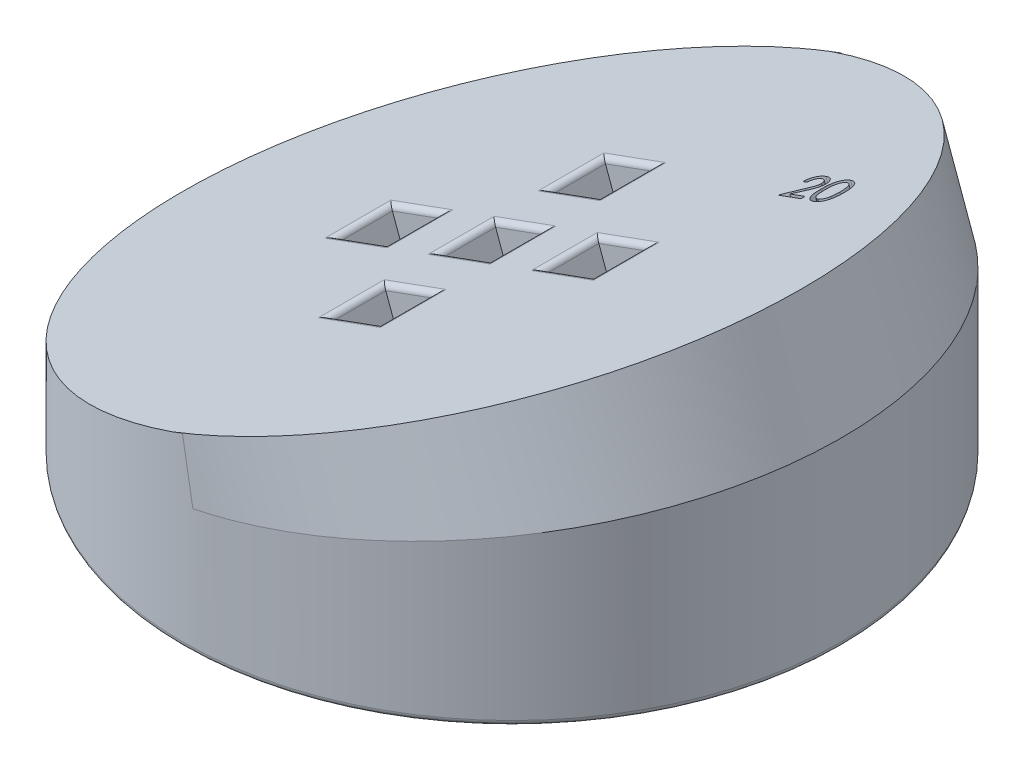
from build123d import *

# Parameters (mm, degrees)
SKETCH1_R           = 30
BOSS_EXTRUDE1_DEPTH = 50
SKETCH4_W           = 5
SKETCH4_H           = 5
CUT_EXTRUDE2_DEPTH  = 3
FILLET2_R           = 0.5
CUT_EXTRUDE10_DEPTH = 45
SKETCH15_W          = 5
SKETCH15_H          = 5
CUT_EXTRUDE11_DEPTH = 3
CUT_EXTRUDE13_DEPTH = 100
FILLET8_R           = 0.5
FILLET9_R           = 0.5
FILLET10_R          = 0.5
FILLET11_R          = 0.5
FILLET12_R          = 0.5
CUT_EXTRUDE14_DEPTH = 4


with BuildPart() as part:
    # Sketch1 → Boss-Extrude1 (new body)
    with BuildSketch(Plane(origin=(0, 0, 0), x_dir=(1, 0, 0), z_dir=(0, 1, 0))):
        with Locations(Location((0, 0, 0), (0, 0, 270))):
            Circle(SKETCH1_R)
    extrude(amount=BOSS_EXTRUDE1_DEPTH)

    # Sketch4 → Cut-Extrude2 (cut)
    with BuildSketch(Plane(origin=(0, 0, 0), x_dir=(-1, 0, 0), z_dir=(0, -1, 0))):
        Rectangle(SKETCH4_W, SKETCH4_H)
        with Locations((0, -10)):
            Rectangle(SKETCH4_W, SKETCH4_H)
        with Locations((10, 0)):
            Rectangle(SKETCH4_W, SKETCH4_H)
        with Locations((-10, 0)):
            Rectangle(SKETCH4_W, SKETCH4_H)
        with Locations((0, 10)):
            Rectangle(SKETCH4_W, SKETCH4_H)
    extrude(amount=-CUT_EXTRUDE2_DEPTH, mode=Mode.SUBTRACT)

    # Fillet2
    fillet2_edges = [part.edges().sort_by_distance(p)[0] for p in [
        (0, 0, -30),
        (-2.5, 0, 10),
        (0, 0, 7.5),
        (2.5, 0, 10),
        (0, 0, 12.5),
        (-12.5, 0, 0),
        (-10, 0, -2.5),
        (-7.5, 0, 0),
        (-10, 0, 2.5),
        (7.5, 0, 0),
        (10, 0, -2.5),
        (12.5, 0, 0),
        (10, 0, 2.5),
        (2.5, 0, -10),
        (0, 0, -7.5),
        (-2.5, 0, -10),
        (0, 0, -12.5),
        (-2.5, 0, 0),
        (0, 0, -2.5),
        (2.5, 0, 0),
        (0, 0, 2.5),
    ]]
    fillet(fillet2_edges, radius=FILLET2_R)

    # Sketch13 → Cut-Extrude10 (cut, symmetric)
    with BuildSketch(Plane.XY.offset(3.5)):
        Polygon((-30, 6), (30, 27.838214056), (30, 50), (-30, 50), align=None)
    extrude(amount=CUT_EXTRUDE10_DEPTH, both=True, mode=Mode.SUBTRACT)

    # Sketch15 → Cut-Extrude11 (cut)
    with BuildSketch(Plane(origin=(-5.437696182, 14.939947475, 0), x_dir=(0.9396926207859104, 0.342020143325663, 0), z_dir=(-0.34202014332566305, 0.9396926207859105, 0))):
        with Locations((-6.138657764, 0)):
            Rectangle(SKETCH15_W, SKETCH15_H)
        with Locations((3.861342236, 0)):
            Rectangle(SKETCH15_W, SKETCH15_H)
        with Locations((13.861342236, 0)):
            Rectangle(SKETCH15_W, SKETCH15_H)
        with Locations((3.861342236, -10)):
            Rectangle(SKETCH15_W, SKETCH15_H)
        with Locations((3.861342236, 10)):
            Rectangle(SKETCH15_W, SKETCH15_H)
    extrude(amount=-CUT_EXTRUDE11_DEPTH, mode=Mode.SUBTRACT)

    # Sketch24 → Cut-Extrude13 (cut)
    with BuildSketch(Plane(origin=(-5.437696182, 14.939947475, 0), x_dir=(0.9396926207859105, 0.342020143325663, 0), z_dir=(-0.342020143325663, 0.9396926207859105, 0))):
        with BuildLine():
            ThreePointArc((4.79407836, 29.98549655), (33.861342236, 0), (4.79407836, -29.98549655))
            add(Edge.make_bspline(
                [(5.786675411, -30), (5.290256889, -30), (4.79407836, -29.98549655)],
                knots=[4.71238898, 4.71238898, 4.71238898, 4.746709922, 4.746709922, 4.746709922], degree=2, weights=[1, 0.993600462, 0.987480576]))
            add(Edge.make_bspline(
                [(37.712008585, 0), (37.712008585, -30), (5.786675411, -30)],
                knots=[3.141592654, 3.141592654, 3.141592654, 4.71238898, 4.71238898, 4.71238898], degree=2, weights=[1, 0.707106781, 1]))
            add(Edge.make_bspline(
                [(4.79407836, 29.98549655), (5.290256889, 30), (5.786675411, 30), (37.712008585, 30), (37.712008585, 0)],
                knots=[1.536475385, 1.536475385, 1.536475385, 1.570796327, 1.570796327, 3.141592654, 3.141592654, 3.141592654], degree=2, weights=[0.987480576, 0.993600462, 1, 0.707106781, 1]))
        make_face()
    extrude(amount=-CUT_EXTRUDE13_DEPTH, mode=Mode.SUBTRACT)

    # Fillet8
    fillet8_edges = [part.edges().sort_by_distance(p)[0] for p in [
        (-4.158452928, 15.405553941, -10),
        (-1.809221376, 16.2606043, -7.5),
        (0.540010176, 17.115654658, -10),
        (-1.809221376, 16.2606043, -12.5),
    ]]
    fillet(fillet8_edges, radius=FILLET8_R)

    # Fillet9
    fillet9_edges = [part.edges().sort_by_distance(p)[0] for p in [
        (5.238473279, 18.825755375, 0),
        (7.587704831, 19.680805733, 2.5),
        (9.936936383, 20.535856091, 0),
        (7.587704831, 19.680805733, -2.5),
    ]]
    fillet(fillet9_edges, radius=FILLET9_R)

    # Fillet10
    fillet10_edges = [part.edges().sort_by_distance(p)[0] for p in [
        (-13.555379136, 11.985352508, 0),
        (-11.206147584, 12.840402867, 2.5),
        (-8.856916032, 13.695453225, 0),
        (-11.206147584, 12.840402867, -2.5),
    ]]
    fillet(fillet10_edges, radius=FILLET10_R)

    # Fillet11
    fillet11_edges = [part.edges().sort_by_distance(p)[0] for p in [
        (-4.158452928, 15.405553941, 10),
        (-1.809221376, 16.2606043, 12.5),
        (0.540010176, 17.115654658, 10),
        (-1.809221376, 16.2606043, 7.5),
    ]]
    fillet(fillet11_edges, radius=FILLET11_R)

    # Fillet12
    fillet12_edges = [part.edges().sort_by_distance(p)[0] for p in [
        (-4.158452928, 15.405553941, 0),
        (-1.809221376, 16.2606043, 2.5),
        (0.540010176, 17.115654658, 0),
        (-1.809221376, 16.2606043, -2.5),
    ]]
    fillet(fillet12_edges, radius=FILLET12_R)

    # Sketch25 → Cut-Extrude14 (cut)
    # profile 1 of 2: a face of its own
    with BuildSketch(Plane(origin=(-5.437696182, 14.939947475, 0), x_dir=(0.9396926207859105, 0.342020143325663, 0), z_dir=(-0.342020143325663, 0.9396926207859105, 0))):
        with BuildLine():
            Line((20.203281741, 13.312576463), (19.800682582, 13.312576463))
            add(Edge.make_bspline(
                [(19.800682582, 13.312576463), (19.802573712, 13.353543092), (19.806272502, 13.433668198), (19.822697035, 13.55041943), (19.849303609, 13.660428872), (19.882886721, 13.764629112), (19.927685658, 13.861717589), (19.979374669, 13.953386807), (20.041775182, 14.037715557), (20.112291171, 14.114837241), (20.188838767, 14.184905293), (20.271127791, 14.245323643), (20.357767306, 14.296808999), (20.448774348, 14.33882139), (20.544327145, 14.371350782), (20.644153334, 14.395021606), (20.748571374, 14.409259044), (20.819750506, 14.410822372), (20.855835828, 14.411614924)],
                knots=[0, 0, 0, 0, 1.154964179, 2.258951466, 3.315045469, 4.34063582, 5.337653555, 6.322213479, 7.300594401, 8.285733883, 9.262436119, 10.219305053, 11.156568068, 12.097250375, 13.037875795, 13.995471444, 14.983774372, 16, 16, 16, 16], degree=3))
            add(Edge.make_bspline(
                [(20.855835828, 14.411614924), (20.893617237, 14.41084208), (20.96775481, 14.409325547), (21.075716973, 14.39505478), (21.177893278, 14.37204318), (21.274313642, 14.340617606), (21.364802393, 14.298656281), (21.449537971, 14.24805555), (21.527705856, 14.187235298), (21.599873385, 14.119181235), (21.663615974, 14.044321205), (21.721188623, 13.967356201), (21.768777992, 13.886725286), (21.808645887, 13.803900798), (21.83932486, 13.718202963), (21.860990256, 13.629980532), (21.873976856, 13.539173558), (21.875749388, 13.477770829), (21.876644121, 13.446776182)],
                knots=[0, 0, 0, 0, 1.156722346, 2.269809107, 3.328396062, 4.361258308, 5.3694338, 6.377253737, 7.377324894, 8.397019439, 9.4098266, 10.385180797, 11.337325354, 12.27255833, 13.196816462, 14.119704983, 15.050871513, 16, 16, 16, 16], degree=3))
            add(Edge.make_bspline(
                [(21.876644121, 13.446776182), (21.875015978, 13.403419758), (21.871781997, 13.317300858), (21.846879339, 13.189892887), (21.805015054, 13.066588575), (21.7566578, 12.966186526), (21.707750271, 12.885030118), (21.662868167, 12.818042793), (21.610143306, 12.745609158), (21.548444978, 12.668214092), (21.480226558, 12.584086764), (21.402778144, 12.495397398), (21.318496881, 12.400350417), (21.258388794, 12.336350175), (21.227270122, 12.303216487)],
                knots=[0, 0, 0, 0, 1.155755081, 2.295677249, 3.447123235, 4.6205014, 5.259503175, 5.973005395, 6.77029923, 7.648035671, 8.612336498, 9.658570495, 10.787814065, 12, 12, 12, 12], degree=3))
            Line((21.227270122, 12.303216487), (20.446240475, 11.521550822))
            Line((20.446240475, 11.521550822), (21.917349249, 11.521550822))
            Line((21.917349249, 11.521550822), (21.917349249, 11.155204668))
            Line((21.917349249, 11.155204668), (19.678567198, 11.155204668))
            Line((19.678567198, 11.155204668), (20.893360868, 12.496565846))
            add(Edge.make_bspline(
                [(20.893360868, 12.496565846), (20.922295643, 12.527424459), (20.977822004, 12.586642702), (21.05607855, 12.673328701), (21.126683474, 12.753468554), (21.190013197, 12.827004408), (21.244409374, 12.894924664), (21.291335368, 12.956230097), (21.33025997, 13.011210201), (21.370683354, 13.07592636), (21.410738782, 13.153503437), (21.444813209, 13.248136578), (21.465259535, 13.344777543), (21.468147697, 13.409792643), (21.469592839, 13.442324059)],
                knots=[0, 0, 0, 0, 1.341560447, 2.574479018, 3.703506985, 4.728875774, 5.651874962, 6.462761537, 7.177175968, 7.787249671, 8.88179658, 9.938774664, 10.968630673, 12, 12, 12, 12], degree=3))
            add(Edge.make_bspline(
                [(21.469592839, 13.442324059), (21.469236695, 13.462505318), (21.468531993, 13.502438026), (21.45892454, 13.560914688), (21.445390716, 13.617633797), (21.424458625, 13.671683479), (21.399239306, 13.724127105), (21.367694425, 13.774286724), (21.329814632, 13.821697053), (21.287676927, 13.867424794), (21.241071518, 13.908711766), (21.191845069, 13.94574014), (21.139392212, 13.975811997), (21.085147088, 14.002110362), (21.027423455, 14.020754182), (20.967640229, 14.034635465), (20.905327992, 14.04425131), (20.862869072, 14.044925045), (20.841207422, 14.045268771)],
                knots=[0, 0, 0, 0, 0.999432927, 1.977580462, 2.931018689, 3.885672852, 4.844657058, 5.812871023, 6.815890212, 7.849665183, 8.891901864, 9.898878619, 10.897592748, 11.885014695, 12.882178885, 13.896915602, 14.927050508, 16, 16, 16, 16], degree=3))
            add(Edge.make_bspline(
                [(20.841207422, 14.045268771), (20.820613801, 14.044846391), (20.780100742, 14.044015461), (20.720435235, 14.035442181), (20.663163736, 14.021483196), (20.608093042, 14.00212081), (20.554824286, 13.97823323), (20.504659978, 13.947286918), (20.456780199, 13.911286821), (20.410551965, 13.870882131), (20.368478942, 13.823479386), (20.330847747, 13.769640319), (20.297617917, 13.709306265), (20.269214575, 13.642582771), (20.245675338, 13.569294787), (20.226792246, 13.489531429), (20.212193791, 13.403257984), (20.20630738, 13.343362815), (20.203281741, 13.312576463)],
                knots=[0, 0, 0, 0, 0.911540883, 1.79324023, 2.663162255, 3.518366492, 4.375475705, 5.243419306, 6.122264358, 7.02676621, 7.957780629, 8.921596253, 9.930241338, 11.002848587, 12.128200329, 13.335197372, 14.630280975, 16, 16, 16, 16], degree=3))
        make_face()
    # profile 2 of 2: a face of its own
    with BuildSketch(Plane(origin=(-5.437696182, 14.939947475, 0), x_dir=(0.9396926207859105, 0.342020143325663, 0), z_dir=(-0.342020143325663, 0.9396926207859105, 0))):
        with BuildLine():
            add(Edge.make_bspline(
                [(22.161580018, 12.741432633), (22.161883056, 12.791896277), (22.162471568, 12.889898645), (22.168813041, 13.032466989), (22.179752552, 13.166288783), (22.193803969, 13.291368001), (22.213243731, 13.407790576), (22.235486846, 13.515614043), (22.26286744, 13.614851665), (22.294848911, 13.705680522), (22.330757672, 13.789713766), (22.370239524, 13.868003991), (22.413044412, 13.941545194), (22.458883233, 14.010311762), (22.50992311, 14.072771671), (22.563167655, 14.131063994), (22.620616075, 14.184050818), (22.681741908, 14.231466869), (22.744973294, 14.274335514), (22.8110579, 14.310468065), (22.878464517, 14.341942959), (22.948052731, 14.367403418), (23.019317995, 14.38718134), (23.092515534, 14.400993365), (23.167297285, 14.410504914), (23.217975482, 14.411243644), (23.243446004, 14.411614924)],
                knots=[0, 0, 0, 0, 1.622528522, 3.151013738, 4.587225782, 5.939257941, 7.196658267, 8.381214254, 9.47772444, 10.503964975, 11.475138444, 12.414102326, 13.321377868, 14.209997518, 15.068075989, 15.912287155, 16.746865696, 17.577313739, 18.397854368, 19.200328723, 19.996378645, 20.787862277, 21.580050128, 22.371504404, 23.181529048, 24, 24, 24, 24], degree=3))
            add(Edge.make_bspline(
                [(23.243446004, 14.411614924), (23.271231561, 14.410883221), (23.326075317, 14.409438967), (23.407466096, 14.401579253), (23.486128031, 14.385700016), (23.563140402, 14.365786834), (23.637255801, 14.338565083), (23.709942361, 14.307261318), (23.778962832, 14.267612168), (23.846671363, 14.224241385), (23.910746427, 14.174226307), (23.972031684, 14.119881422), (24.028616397, 14.059351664), (24.082563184, 13.994719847), (24.131104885, 13.923454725), (24.177315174, 13.848051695), (24.218231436, 13.766632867), (24.25705204, 13.680638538), (24.290420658, 13.587782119), (24.320622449, 13.488593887), (24.345097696, 13.381838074), (24.365400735, 13.267846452), (24.381047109, 13.146427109), (24.392602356, 13.017868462), (24.398635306, 12.882050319), (24.399776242, 12.789139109), (24.40036207, 12.741432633)],
                knots=[0, 0, 0, 0, 0.875057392, 1.727207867, 2.570264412, 3.399251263, 4.229017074, 5.053828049, 5.887584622, 6.731829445, 7.583639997, 8.443960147, 9.308026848, 10.190032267, 11.091770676, 12.020167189, 12.972467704, 13.958579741, 14.989078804, 16.076606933, 17.221320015, 18.435081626, 19.720875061, 21.074561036, 22.497895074, 24, 24, 24, 24], degree=3))
            add(Edge.make_bspline(
                [(24.40036207, 12.741432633), (24.399770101, 12.693938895), (24.398617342, 12.601452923), (24.392670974, 12.466259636), (24.380816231, 12.338400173), (24.36621995, 12.217515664), (24.345746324, 12.103973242), (24.320817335, 11.997712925), (24.29286149, 11.898176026), (24.258686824, 11.806234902), (24.220845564, 11.72034213), (24.179790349, 11.639651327), (24.134574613, 11.56400348), (24.084509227, 11.494219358), (24.031979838, 11.428103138), (23.974704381, 11.367952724), (23.913726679, 11.31262161), (23.849194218, 11.262814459), (23.781845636, 11.217898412), (23.711258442, 11.179983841), (23.639211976, 11.146330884), (23.564097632, 11.120826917), (23.487438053, 11.099061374), (23.407942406, 11.085001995), (23.326348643, 11.075693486), (23.271245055, 11.074431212), (23.243446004, 11.073794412)],
                knots=[0, 0, 0, 0, 1.496607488, 2.914388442, 4.262485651, 5.541812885, 6.749953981, 7.895567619, 8.980172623, 10.005210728, 10.983286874, 11.936336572, 12.856292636, 13.757107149, 14.640766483, 15.514956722, 16.370989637, 17.232841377, 18.081413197, 18.918442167, 19.755471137, 20.583656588, 21.41504191, 22.264086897, 23.124254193, 24, 24, 24, 24], degree=3))
            add(Edge.make_bspline(
                [(23.243446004, 11.073794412), (23.217771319, 11.074230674), (23.166920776, 11.075094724), (23.091831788, 11.083569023), (23.018684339, 11.097633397), (22.947693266, 11.117345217), (22.878359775, 11.142371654), (22.810984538, 11.172687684), (22.746010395, 11.209396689), (22.68281728, 11.250642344), (22.622322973, 11.297556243), (22.5659767, 11.350580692), (22.512423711, 11.408448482), (22.462724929, 11.471783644), (22.415782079, 11.540177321), (22.373463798, 11.614273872), (22.334009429, 11.693281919), (22.297430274, 11.777810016), (22.264402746, 11.869326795), (22.238060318, 11.969622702), (22.213219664, 12.077603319), (22.1949902, 12.194361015), (22.179173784, 12.319014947), (22.169997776, 12.452374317), (22.162156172, 12.593996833), (22.161775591, 12.691386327), (22.161580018, 12.741432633)],
                knots=[0, 0, 0, 0, 0.82614074, 1.636230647, 2.42850654, 3.22151677, 4.005075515, 4.799112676, 5.596456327, 6.404618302, 7.226350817, 8.05679228, 8.892237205, 9.761873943, 10.645770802, 11.559890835, 12.505927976, 13.487073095, 14.523090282, 15.633895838, 16.822583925, 18.088023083, 19.435493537, 20.865857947, 22.389433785, 24, 24, 24, 24], degree=3))
        make_face()
        with BuildLine():
            add(Edge.make_bspline(
                [(22.5686313, 12.742704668), (22.568794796, 12.700086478), (22.569111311, 12.617580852), (22.573811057, 12.498191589), (22.580502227, 12.387021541), (22.590511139, 12.284100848), (22.603857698, 12.189276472), (22.619654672, 12.102679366), (22.637665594, 12.024143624), (22.659623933, 11.953540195), (22.683937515, 11.889209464), (22.71097109, 11.829984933), (22.739040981, 11.77452486), (22.770660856, 11.723928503), (22.804147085, 11.677504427), (22.840104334, 11.635429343), (22.877248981, 11.596780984), (22.930236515, 11.553865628), (22.998129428, 11.508997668), (23.0824104, 11.470090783), (23.167326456, 11.444408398), (23.224616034, 11.441554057), (23.252986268, 11.440140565)],
                knots=[0, 0, 0, 0, 1.564601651, 3.028951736, 4.386019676, 5.653114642, 6.824348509, 7.900668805, 8.88431448, 9.780488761, 10.613163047, 11.407444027, 12.169849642, 12.89344098, 13.595615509, 14.26934431, 14.924332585, 15.560171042, 16.769153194, 17.901006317, 18.960562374, 20, 20, 20, 20], degree=3))
            add(Edge.make_bspline(
                [(23.252986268, 11.440140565), (23.285135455, 11.441822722), (23.34923376, 11.445176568), (23.443635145, 11.469596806), (23.534150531, 11.510582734), (23.605870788, 11.556887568), (23.660058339, 11.601924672), (23.699191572, 11.640264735), (23.735261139, 11.683068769), (23.769311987, 11.729684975), (23.800100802, 11.780875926), (23.829788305, 11.83547978), (23.855636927, 11.894806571), (23.870576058, 11.936148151), (23.878191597, 11.957222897)],
                knots=[0, 0, 0, 0, 1.331887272, 2.655486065, 4.012646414, 5.436183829, 6.178803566, 6.930724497, 7.703763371, 8.496530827, 9.320959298, 10.178042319, 11.071218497, 12, 12, 12, 12], degree=3))
            add(Edge.make_bspline(
                [(23.878191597, 11.957222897), (23.887366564, 11.984912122), (23.90607037, 12.041358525), (23.929503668, 12.129241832), (23.948903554, 12.221457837), (23.965607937, 12.317515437), (23.9782916, 12.417898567), (23.987058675, 12.522510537), (23.992087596, 12.631351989), (23.992898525, 12.70517452), (23.993310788, 12.742704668)],
                knots=[0, 0, 0, 0, 0.877617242, 1.789083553, 2.735016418, 3.71249782, 4.722174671, 5.778575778, 6.870664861, 8, 8, 8, 8], degree=3))
            add(Edge.make_bspline(
                [(23.993310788, 12.742704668), (23.993212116, 12.780238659), (23.993019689, 12.853436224), (23.98730056, 12.960506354), (23.980383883, 13.062422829), (23.968451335, 13.158850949), (23.955096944, 13.250271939), (23.936779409, 13.336039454), (23.917132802, 13.417009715), (23.892588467, 13.492182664), (23.865754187, 13.562316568), (23.837451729, 13.627644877), (23.806849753, 13.688219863), (23.77313361, 13.743281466), (23.737547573, 13.793737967), (23.699958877, 13.839285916), (23.659807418, 13.879668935), (23.603674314, 13.92520165), (23.531311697, 13.972591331), (23.440828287, 14.015121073), (23.347395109, 14.040193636), (23.284291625, 14.043585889), (23.252986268, 14.045268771)],
                knots=[0, 0, 0, 0, 1.353201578, 2.638969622, 3.865559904, 5.035676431, 6.141732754, 7.195734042, 8.19695873, 9.144657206, 10.044788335, 10.904062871, 11.710933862, 12.489720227, 13.229995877, 13.935715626, 14.616825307, 15.279494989, 16.538995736, 17.725922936, 18.871840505, 20, 20, 20, 20], degree=3))
            add(Edge.make_bspline(
                [(23.252986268, 14.045268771), (23.224624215, 14.043827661), (23.16714671, 14.040907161), (23.082101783, 14.01558146), (22.998124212, 13.976366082), (22.930686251, 13.931467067), (22.878136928, 13.888597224), (22.840485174, 13.850827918), (22.805699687, 13.808515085), (22.772130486, 13.762464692), (22.741478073, 13.711535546), (22.711706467, 13.656656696), (22.685475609, 13.596921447), (22.660807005, 13.53254143), (22.639079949, 13.461808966), (22.620290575, 13.383393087), (22.603499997, 13.296891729), (22.591399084, 13.201875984), (22.581226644, 13.098798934), (22.573613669, 12.987454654), (22.569168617, 12.867825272), (22.568814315, 12.785321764), (22.5686313, 12.742704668)],
                knots=[0, 0, 0, 0, 1.039778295, 2.107176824, 3.232337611, 4.43520669, 5.071253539, 5.720927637, 6.389866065, 7.081397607, 7.811854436, 8.571243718, 9.372887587, 10.205834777, 11.102302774, 12.088086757, 13.166194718, 14.33675119, 15.604261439, 16.970055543, 18.43488556, 20, 20, 20, 20], degree=3))
        make_face(mode=Mode.SUBTRACT)
    extrude(amount=-CUT_EXTRUDE14_DEPTH, mode=Mode.SUBTRACT)


solid = part.part
